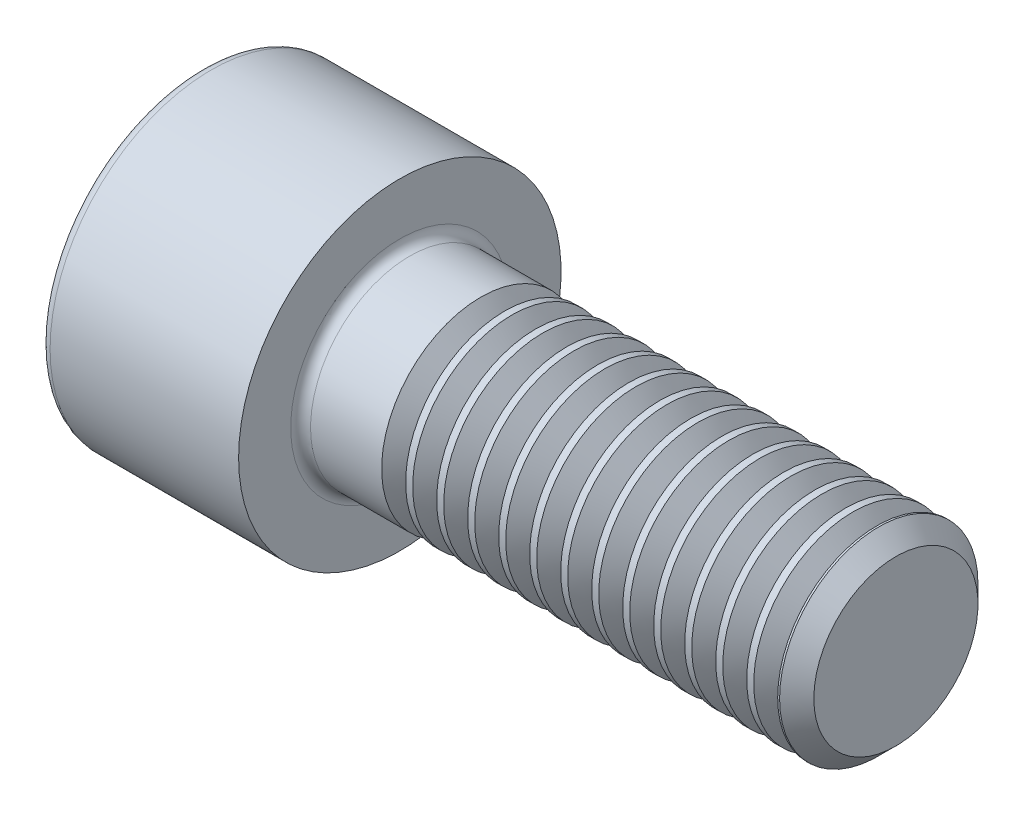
from build123d import *

# Parameters (mm, degrees)
FILLET1_R       = 0.4
FILLET2_R       = 0.4
HEX_2_DEPTH     = 4
THDSCHPAT_COUNT = 13
THDSCHPAT_PITCH = 1.25


with BuildPart() as part:
    # BodySke → Base-Revolve (revolve)
    with BuildSketch(Plane.XY, mode=Mode.PRIVATE) as base_revolve_sk:
        Polygon((0, 0), (0, 6.5), (8, 6.5), (8, 4), (27.3095, 4), (28, 3.3095), (28, 0), align=None)
    revolve(base_revolve_sk.sketch.rotate(Axis((-31.75, 0, 0), (1, 0, 0)), 90), axis=Axis((-31.75, 0, 0), (1, 0, 0)))

    # Fillet1
    fillet1_edges = [part.edges().sort_by_distance(p)[0] for p in [
        (8, 0, -4),
    ]]
    fillet(fillet1_edges, radius=FILLET1_R)

    # Fillet2
    fillet2_edges = [part.edges().sort_by_distance(p)[0] for p in [
        (0, 0, -6.5),
    ]]
    fillet(fillet2_edges, radius=FILLET2_R)

    # Sketch2 → Hex-PreBroach (revolve, cut)
    with BuildSketch(Plane.XY, mode=Mode.PRIVATE) as hex_prebroach_sk:
        Polygon((0, 3.0475), (4, 3.0475), (5.759474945, 0), (0, 0), align=None)
    revolve(hex_prebroach_sk.sketch.rotate(Axis((0, 0, 0), (1, 0, 0)), 90), axis=Axis((0, 0, 0), (1, 0, 0)), mode=Mode.SUBTRACT)

    # Sketch3 → Hex 2 (cut)
    with BuildSketch(Plane(origin=(0, 0, 0), x_dir=(0, 0.500000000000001, 0.866025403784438), z_dir=(-1, 0, 0))):
        Polygon((1.759474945, 3.0475), (-1.759474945, 3.0475), (-3.518949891, 0), (-1.759474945, -3.0475), (1.759474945, -3.0475), (3.518949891, 0), align=None)
    extrude(amount=-HEX_2_DEPTH, mode=Mode.SUBTRACT)

    # ThdSchSke → ThreadSchematic (revolve, cut)
    with BuildSketch(Plane.XY):
        Polygon((11.75, -3.3095), (11.266506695, -4), (11.266506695, -5), (12.233493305, -5), (12.233493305, -4), align=None)
    threadschematic = revolve(axis=Axis((-3.175, 0, 0), (1, 0, 0)), mode=Mode.SUBTRACT)

    # ThdSchPat: ThreadSchematic ×13
    with Locations(*[(i * THDSCHPAT_PITCH, 0, 0) for i in range(1, THDSCHPAT_COUNT)]):
        add(threadschematic, mode=Mode.SUBTRACT)


solid = part.part
